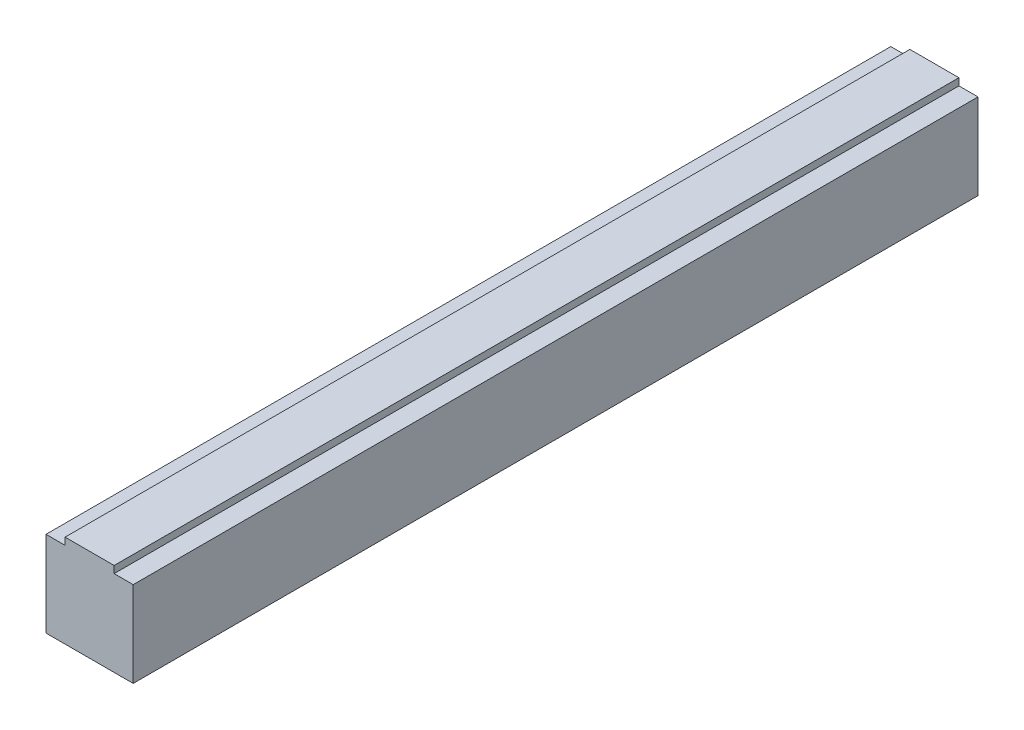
from build123d import *

# Parameters (mm, degrees)
DODANIE_WYCI_GNI_CIE2_START = -5
DODANIE_WYCI_GNI_CIE2_DEPTH = 155


with BuildPart() as part:
    # Szkic2 → Dodanie-wyci_gni_cie2 (new body)
    with BuildSketch(Plane.XY.offset(DODANIE_WYCI_GNI_CIE2_START)):
        Polygon((4.5, 29.760650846), (4.5, 28.460650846), (8, 28.460650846), (8, 12.760650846), (-8, 12.760650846), (-8, 28.460650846), (-4.5, 28.460650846), (-4.5, 29.760650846), align=None)
    extrude(amount=-DODANIE_WYCI_GNI_CIE2_DEPTH)


solid = part.part
